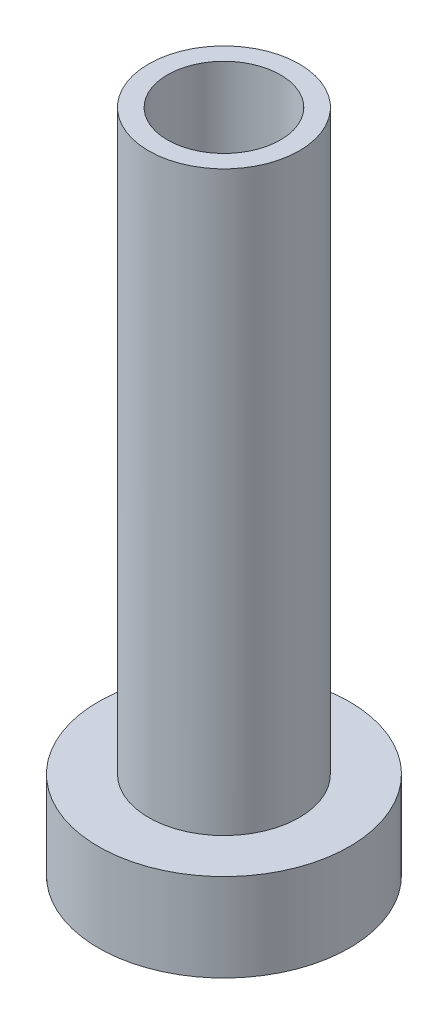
from build123d import *

# Parameters (mm, degrees)
ESQUISSE2_R             = 4.75
ENL_V_MAT_EXTRU_1_DEPTH = 40
CHANFREIN1_SIZE         = 1
ESQUISSE3_R             = 6
ENL_V_MAT_EXTRU_2_DEPTH = 22
ESQUISSE4_R             = 4.5
ENL_V_MAT_EXTRU_3_DEPTH = 30


with BuildPart() as part:
    # Esquisse1 → R_volution1 (revolve)
    with BuildSketch(Plane.XY, mode=Mode.PRIVATE) as r_volution1_sk:
        Polygon((-4, 0), (-10, 0), (-10, 7), (-6, 7), (-6, 75), (-4, 75), align=None)
    revolve(r_volution1_sk.sketch.rotate(Axis((0, 0, 0), (0, 1, 0)), 270), axis=Axis((0, 0, 0), (0, 1, 0)))

    # Esquisse2 → Enl_v. mat.-Extru.1 (cut)
    with BuildSketch(Plane(origin=(0, 0, 0), x_dir=(1, 0, 0), z_dir=(0, 1, 0))):
        with Locations(Location((0, 0, 0), (0, 0, 270))):
            Circle(ESQUISSE2_R)
    extrude(amount=ENL_V_MAT_EXTRU_1_DEPTH, mode=Mode.SUBTRACT)

    # Chanfrein1
    chanfrein1_edges = [part.edges().sort_by_distance(p)[0] for p in [
        (0, 0, -4.75),
    ]]
    chamfer(chanfrein1_edges, length=CHANFREIN1_SIZE)

    # Esquisse3 → Enl_v. mat.-Extru.2 (cut)
    with BuildSketch(Plane(origin=(0, 75, 0), x_dir=(1, 0, 0), z_dir=(0, 1, 0))):
        with Locations(Location((0, 0, 0), (0, 0, 90))):
            Circle(ESQUISSE3_R)
    extrude(amount=-ENL_V_MAT_EXTRU_2_DEPTH, mode=Mode.SUBTRACT)

    # Esquisse4 → Enl_v. mat.-Extru.3 (cut)
    with BuildSketch(Plane(origin=(0, 53, 0), x_dir=(1, 0, 0), z_dir=(0, 1, 0))):
        with Locations(Location((0, 0, 0), (0, 0, 270))):
            Circle(ESQUISSE4_R)
    extrude(amount=-ENL_V_MAT_EXTRU_3_DEPTH, mode=Mode.SUBTRACT)


solid = part.part
